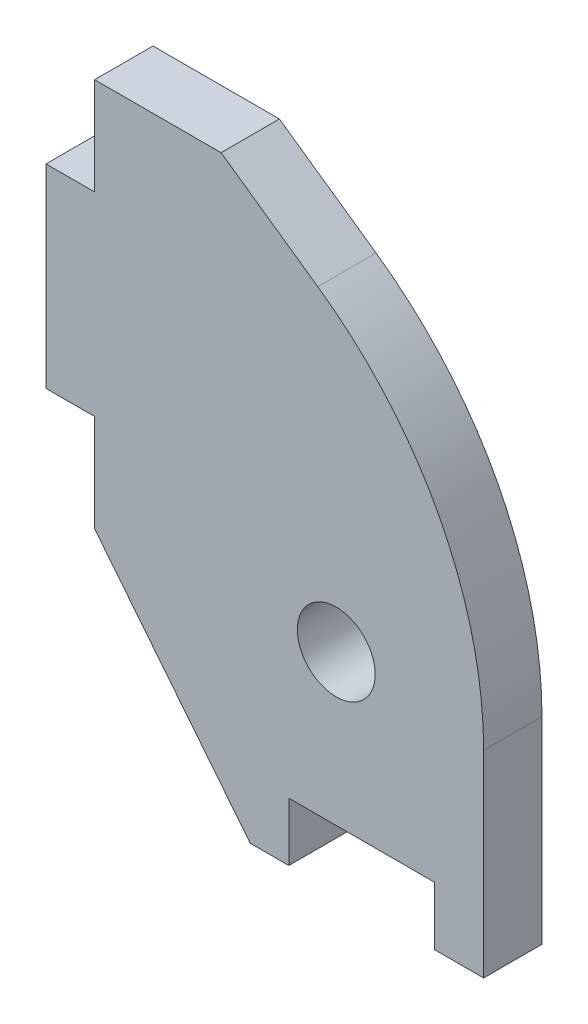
ISO-10303-21;
HEADER;
FILE_DESCRIPTION(('STEP AP214'),'2;1');
FILE_NAME('part.step','',(''),(''),'','','');
FILE_SCHEMA(('AUTOMOTIVE_DESIGN { 1 0 10303 214 1 1 1 1 }'));
ENDSEC;
DATA;
#1=APPLICATION_CONTEXT('core data for automotive mechanical design processes');
#2=APPLICATION_PROTOCOL_DEFINITION('international standard','automotive_design',2000,#1);
#3=PRODUCT_CONTEXT('',#1,'mechanical');
#4=PRODUCT('Part','Part','',(#3));
#5=PRODUCT_RELATED_PRODUCT_CATEGORY('part','',(#4));
#6=PRODUCT_DEFINITION_FORMATION('','',#4);
#7=PRODUCT_DEFINITION_CONTEXT('part definition',#1,'design');
#8=PRODUCT_DEFINITION('design','',#6,#7);
#9=PRODUCT_DEFINITION_SHAPE('','',#8);
#10=(LENGTH_UNIT() NAMED_UNIT(*) SI_UNIT(.MILLI.,.METRE.));
#11=(NAMED_UNIT(*) PLANE_ANGLE_UNIT() SI_UNIT($,.RADIAN.));
#12=(NAMED_UNIT(*) SI_UNIT($,.STERADIAN.) SOLID_ANGLE_UNIT());
#13=UNCERTAINTY_MEASURE_WITH_UNIT(LENGTH_MEASURE(1.E-05),#10,'distance_accuracy_value','');
#14=(GEOMETRIC_REPRESENTATION_CONTEXT(3) GLOBAL_UNCERTAINTY_ASSIGNED_CONTEXT((#13)) GLOBAL_UNIT_ASSIGNED_CONTEXT((#10,
#11,#12)) REPRESENTATION_CONTEXT('',''));
#15=CARTESIAN_POINT('',(0.,0.,0.));
#16=DIRECTION('',(0.,0.,1.));
#17=DIRECTION('',(1.,0.,0.));
#18=AXIS2_PLACEMENT_3D('',#15,#16,#17);
#19=CARTESIAN_POINT('',(0.,30.,3.));
#20=DIRECTION('',(1.,0.,0.));
#21=DIRECTION('',(0.,0.,-1.));
#22=AXIS2_PLACEMENT_3D('',#19,#20,#21);
#23=PLANE('',#22);
#24=DIRECTION('',(0.,0.,-1.));
#25=VECTOR('',#24,1.);
#26=CARTESIAN_POINT('',(0.,25.,0.));
#27=LINE('',#26,#25);
#28=CARTESIAN_POINT('',(0.,25.,3.));
#29=VERTEX_POINT('',#28);
#30=CARTESIAN_POINT('',(0.,25.,0.));
#31=VERTEX_POINT('',#30);
#32=EDGE_CURVE('E56',#29,#31,#27,.T.);
#33=ORIENTED_EDGE('',*,*,#32,.F.);
#34=DIRECTION('',(0.,-1.,0.));
#35=VECTOR('',#34,1.);
#36=CARTESIAN_POINT('',(0.,30.,3.));
#37=LINE('',#36,#35);
#38=CARTESIAN_POINT('',(0.,30.,3.));
#39=VERTEX_POINT('',#38);
#40=EDGE_CURVE('E782',#39,#29,#37,.T.);
#41=ORIENTED_EDGE('',*,*,#40,.F.);
#42=DIRECTION('',(0.,0.,-1.));
#43=VECTOR('',#42,1.);
#44=CARTESIAN_POINT('',(0.,30.,3.));
#45=LINE('',#44,#43);
#46=CARTESIAN_POINT('',(0.,30.,0.));
#47=VERTEX_POINT('',#46);
#48=EDGE_CURVE('E551',#39,#47,#45,.T.);
#49=ORIENTED_EDGE('',*,*,#48,.T.);
#50=DIRECTION('',(0.,-1.,0.));
#51=VECTOR('',#50,1.);
#52=CARTESIAN_POINT('',(0.,30.,0.));
#53=LINE('',#52,#51);
#54=EDGE_CURVE('E603',#47,#31,#53,.T.);
#55=ORIENTED_EDGE('',*,*,#54,.T.);
#56=EDGE_LOOP('',(#33,#41,#49,#55));
#57=FACE_BOUND('',#56,.T.);
#58=ADVANCED_FACE('F41',(#57),#23,.F.);
#59=DIRECTION('',(0.,0.,1.));
#60=VECTOR('',#59,1.);
#61=CARTESIAN_POINT('',(0.,15.,0.));
#62=LINE('',#61,#60);
#63=CARTESIAN_POINT('',(0.,15.,0.));
#64=VERTEX_POINT('',#63);
#65=CARTESIAN_POINT('',(0.,15.,3.));
#66=VERTEX_POINT('',#65);
#67=EDGE_CURVE('E64',#64,#66,#62,.T.);
#68=ORIENTED_EDGE('',*,*,#67,.F.);
#69=CARTESIAN_POINT('',(0.,10.,0.));
#70=VERTEX_POINT('',#69);
#71=EDGE_CURVE('E173',#64,#70,#53,.T.);
#72=ORIENTED_EDGE('',*,*,#71,.T.);
#73=DIRECTION('',(0.,0.,-1.));
#74=VECTOR('',#73,1.);
#75=CARTESIAN_POINT('',(0.,10.,3.));
#76=LINE('',#75,#74);
#77=CARTESIAN_POINT('',(0.,10.,3.));
#78=VERTEX_POINT('',#77);
#79=EDGE_CURVE('E12',#78,#70,#76,.T.);
#80=ORIENTED_EDGE('',*,*,#79,.F.);
#81=EDGE_CURVE('E785',#66,#78,#37,.T.);
#82=ORIENTED_EDGE('',*,*,#81,.F.);
#83=EDGE_LOOP('',(#68,#72,#80,#82));
#84=FACE_BOUND('',#83,.T.);
#85=ADVANCED_FACE('F1338',(#84),#23,.F.);
#86=CARTESIAN_POINT('',(8.,0.,3.));
#87=DIRECTION('',(0.,1.,0.));
#88=DIRECTION('',(0.,0.,1.));
#89=AXIS2_PLACEMENT_3D('',#86,#87,#88);
#90=PLANE('',#89);
#91=DIRECTION('',(1.,0.,0.));
#92=VECTOR('',#91,1.);
#93=CARTESIAN_POINT('',(8.,0.,0.));
#94=LINE('',#93,#92);
#95=CARTESIAN_POINT('',(8.,0.,0.));
#96=VERTEX_POINT('',#95);
#97=CARTESIAN_POINT('',(9.9819559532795,0.,0.));
#98=VERTEX_POINT('',#97);
#99=EDGE_CURVE('E949',#96,#98,#94,.T.);
#100=ORIENTED_EDGE('',*,*,#99,.T.);
#101=DIRECTION('',(0.,0.,1.));
#102=VECTOR('',#101,1.);
#103=CARTESIAN_POINT('',(9.9819559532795,0.,0.));
#104=LINE('',#103,#102);
#105=CARTESIAN_POINT('',(9.9819559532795,0.,3.));
#106=VERTEX_POINT('',#105);
#107=EDGE_CURVE('E1040',#98,#106,#104,.T.);
#108=ORIENTED_EDGE('',*,*,#107,.T.);
#109=DIRECTION('',(1.,0.,0.));
#110=VECTOR('',#109,1.);
#111=CARTESIAN_POINT('',(8.,0.,3.));
#112=LINE('',#111,#110);
#113=CARTESIAN_POINT('',(8.,0.,3.));
#114=VERTEX_POINT('',#113);
#115=EDGE_CURVE('E698',#114,#106,#112,.T.);
#116=ORIENTED_EDGE('',*,*,#115,.F.);
#117=DIRECTION('',(0.,0.,-1.));
#118=VECTOR('',#117,1.);
#119=CARTESIAN_POINT('',(8.,0.,3.));
#120=LINE('',#119,#118);
#121=EDGE_CURVE('E49',#114,#96,#120,.T.);
#122=ORIENTED_EDGE('',*,*,#121,.T.);
#123=EDGE_LOOP('',(#100,#108,#116,#122));
#124=FACE_BOUND('',#123,.T.);
#125=ADVANCED_FACE('F1323',(#124),#90,.F.);
#126=CARTESIAN_POINT('',(0.,10.,3.));
#127=DIRECTION('',(0.78086880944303,0.624695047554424,0.));
#128=DIRECTION('',(-0.624695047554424,0.78086880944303,0.));
#129=AXIS2_PLACEMENT_3D('',#126,#127,#128);
#130=PLANE('',#129);
#131=DIRECTION('',(0.624695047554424,-0.78086880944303,0.));
#132=VECTOR('',#131,1.);
#133=CARTESIAN_POINT('',(0.,10.,0.));
#134=LINE('',#133,#132);
#135=EDGE_CURVE('E953',#70,#96,#134,.T.);
#136=ORIENTED_EDGE('',*,*,#135,.T.);
#137=ORIENTED_EDGE('',*,*,#121,.F.);
#138=DIRECTION('',(0.624695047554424,-0.78086880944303,0.));
#139=VECTOR('',#138,1.);
#140=CARTESIAN_POINT('',(0.,10.,3.));
#141=LINE('',#140,#139);
#142=EDGE_CURVE('E703',#78,#114,#141,.T.);
#143=ORIENTED_EDGE('',*,*,#142,.F.);
#144=ORIENTED_EDGE('',*,*,#79,.T.);
#145=EDGE_LOOP('',(#136,#137,#143,#144));
#146=FACE_BOUND('',#145,.T.);
#147=ADVANCED_FACE('F1320',(#146),#130,.F.);
#148=CARTESIAN_POINT('',(17.4819559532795,0.,3.));
#149=VERTEX_POINT('',#148);
#150=CARTESIAN_POINT('',(20.,0.,3.));
#151=VERTEX_POINT('',#150);
#152=EDGE_CURVE('E702',#149,#151,#112,.T.);
#153=ORIENTED_EDGE('',*,*,#152,.F.);
#154=DIRECTION('',(0.,0.,1.));
#155=VECTOR('',#154,1.);
#156=CARTESIAN_POINT('',(17.4819559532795,0.,0.));
#157=LINE('',#156,#155);
#158=CARTESIAN_POINT('',(17.4819559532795,0.,0.));
#159=VERTEX_POINT('',#158);
#160=EDGE_CURVE('E1139',#159,#149,#157,.T.);
#161=ORIENTED_EDGE('',*,*,#160,.F.);
#162=CARTESIAN_POINT('',(20.,0.,0.));
#163=VERTEX_POINT('',#162);
#164=EDGE_CURVE('E952',#159,#163,#94,.T.);
#165=ORIENTED_EDGE('',*,*,#164,.T.);
#166=DIRECTION('',(0.,0.,-1.));
#167=VECTOR('',#166,1.);
#168=CARTESIAN_POINT('',(20.,0.,3.));
#169=LINE('',#168,#167);
#170=EDGE_CURVE('E440',#151,#163,#169,.T.);
#171=ORIENTED_EDGE('',*,*,#170,.F.);
#172=EDGE_LOOP('',(#153,#161,#165,#171));
#173=FACE_BOUND('',#172,.T.);
#174=ADVANCED_FACE('F1309',(#173),#90,.F.);
#175=CARTESIAN_POINT('',(20.,10.135857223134,3.));
#176=DIRECTION('',(-1.,0.,0.));
#177=DIRECTION('',(0.,0.,1.));
#178=AXIS2_PLACEMENT_3D('',#175,#176,#177);
#179=PLANE('',#178);
#180=DIRECTION('',(0.,1.,0.));
#181=VECTOR('',#180,1.);
#182=CARTESIAN_POINT('',(20.,10.135857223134,0.));
#183=LINE('',#182,#181);
#184=CARTESIAN_POINT('',(20.,10.135857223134,0.));
#185=VERTEX_POINT('',#184);
#186=EDGE_CURVE('E903',#163,#185,#183,.T.);
#187=ORIENTED_EDGE('',*,*,#186,.T.);
#188=DIRECTION('',(0.,0.,-1.));
#189=VECTOR('',#188,1.);
#190=CARTESIAN_POINT('',(20.,10.135857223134,3.));
#191=LINE('',#190,#189);
#192=CARTESIAN_POINT('',(20.,10.135857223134,3.));
#193=VERTEX_POINT('',#192);
#194=EDGE_CURVE('E501',#193,#185,#191,.T.);
#195=ORIENTED_EDGE('',*,*,#194,.F.);
#196=DIRECTION('',(0.,1.,0.));
#197=VECTOR('',#196,1.);
#198=CARTESIAN_POINT('',(20.,10.135857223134,3.));
#199=LINE('',#198,#197);
#200=EDGE_CURVE('E652',#151,#193,#199,.T.);
#201=ORIENTED_EDGE('',*,*,#200,.F.);
#202=ORIENTED_EDGE('',*,*,#170,.T.);
#203=EDGE_LOOP('',(#187,#195,#201,#202));
#204=FACE_BOUND('',#203,.T.);
#205=ADVANCED_FACE('F1351',(#204),#179,.F.);
#206=CARTESIAN_POINT('',(0.,10.135857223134,3.));
#207=DIRECTION('',(0.,0.,-1.));
#208=DIRECTION('',(-1.,0.,0.));
#209=AXIS2_PLACEMENT_3D('',#206,#207,#208);
#210=CYLINDRICAL_SURFACE('',#209,20.);
#211=CARTESIAN_POINT('',(0.,10.135857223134,0.));
#212=DIRECTION('',(0.,0.,1.));
#213=DIRECTION('',(-1.,0.,0.));
#214=AXIS2_PLACEMENT_3D('',#211,#212,#213);
#215=CIRCLE('',#214,20.);
#216=CARTESIAN_POINT('',(11.4715287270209,26.5188981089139,0.));
#217=VERTEX_POINT('',#216);
#218=EDGE_CURVE('E901',#185,#217,#215,.T.);
#219=ORIENTED_EDGE('',*,*,#218,.T.);
#220=DIRECTION('',(0.,0.,-1.));
#221=VECTOR('',#220,1.);
#222=CARTESIAN_POINT('',(11.4715287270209,26.5188981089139,3.));
#223=LINE('',#222,#221);
#224=CARTESIAN_POINT('',(11.4715287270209,26.5188981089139,3.));
#225=VERTEX_POINT('',#224);
#226=EDGE_CURVE('E504',#225,#217,#223,.T.);
#227=ORIENTED_EDGE('',*,*,#226,.F.);
#228=CARTESIAN_POINT('',(0.,10.135857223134,3.));
#229=DIRECTION('',(0.,0.,1.));
#230=DIRECTION('',(-1.,0.,0.));
#231=AXIS2_PLACEMENT_3D('',#228,#229,#230);
#232=CIRCLE('',#231,20.);
#233=EDGE_CURVE('E650',#193,#225,#232,.T.);
#234=ORIENTED_EDGE('',*,*,#233,.F.);
#235=ORIENTED_EDGE('',*,*,#194,.T.);
#236=EDGE_LOOP('',(#219,#227,#234,#235));
#237=FACE_BOUND('',#236,.T.);
#238=ADVANCED_FACE('F1355',(#237),#210,.T.);
#239=CARTESIAN_POINT('',(6.5,30.,3.));
#240=DIRECTION('',(-0.573576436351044,-0.819152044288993,0.));
#241=DIRECTION('',(0.819152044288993,-0.573576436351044,0.));
#242=AXIS2_PLACEMENT_3D('',#239,#240,#241);
#243=PLANE('',#242);
#244=DIRECTION('',(-0.819152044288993,0.573576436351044,0.));
#245=VECTOR('',#244,1.);
#246=CARTESIAN_POINT('',(6.5,30.,0.));
#247=LINE('',#246,#245);
#248=CARTESIAN_POINT('',(6.5,30.,0.));
#249=VERTEX_POINT('',#248);
#250=EDGE_CURVE('E865',#217,#249,#247,.T.);
#251=ORIENTED_EDGE('',*,*,#250,.T.);
#252=DIRECTION('',(0.,0.,-1.));
#253=VECTOR('',#252,1.);
#254=CARTESIAN_POINT('',(6.5,30.,3.));
#255=LINE('',#254,#253);
#256=CARTESIAN_POINT('',(6.5,30.,3.));
#257=VERTEX_POINT('',#256);
#258=EDGE_CURVE('E548',#257,#249,#255,.T.);
#259=ORIENTED_EDGE('',*,*,#258,.F.);
#260=DIRECTION('',(-0.819152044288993,0.573576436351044,0.));
#261=VECTOR('',#260,1.);
#262=CARTESIAN_POINT('',(6.5,30.,3.));
#263=LINE('',#262,#261);
#264=EDGE_CURVE('E600',#225,#257,#263,.T.);
#265=ORIENTED_EDGE('',*,*,#264,.F.);
#266=ORIENTED_EDGE('',*,*,#226,.T.);
#267=EDGE_LOOP('',(#251,#259,#265,#266));
#268=FACE_BOUND('',#267,.T.);
#269=ADVANCED_FACE('F1360',(#268),#243,.F.);
#270=CARTESIAN_POINT('',(0.,30.,3.));
#271=DIRECTION('',(0.,-1.,0.));
#272=DIRECTION('',(0.,0.,-1.));
#273=AXIS2_PLACEMENT_3D('',#270,#271,#272);
#274=PLANE('',#273);
#275=DIRECTION('',(-1.,0.,0.));
#276=VECTOR('',#275,1.);
#277=CARTESIAN_POINT('',(0.,30.,0.));
#278=LINE('',#277,#276);
#279=EDGE_CURVE('E863',#249,#47,#278,.T.);
#280=ORIENTED_EDGE('',*,*,#279,.T.);
#281=ORIENTED_EDGE('',*,*,#48,.F.);
#282=DIRECTION('',(-1.,0.,0.));
#283=VECTOR('',#282,1.);
#284=CARTESIAN_POINT('',(0.,30.,3.));
#285=LINE('',#284,#283);
#286=EDGE_CURVE('E597',#257,#39,#285,.T.);
#287=ORIENTED_EDGE('',*,*,#286,.F.);
#288=ORIENTED_EDGE('',*,*,#258,.T.);
#289=EDGE_LOOP('',(#280,#281,#287,#288));
#290=FACE_BOUND('',#289,.T.);
#291=ADVANCED_FACE('F1366',(#290),#274,.F.);
#292=CARTESIAN_POINT('',(0.,10.135857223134,3.));
#293=DIRECTION('',(0.,0.,-1.));
#294=DIRECTION('',(-1.,0.,0.));
#295=AXIS2_PLACEMENT_3D('',#292,#293,#294);
#296=PLANE('',#295);
#297=CARTESIAN_POINT('',(12.423290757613,10.7287967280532,3.));
#298=DIRECTION('',(0.,0.,1.));
#299=DIRECTION('',(1.,0.,0.));
#300=AXIS2_PLACEMENT_3D('',#297,#298,#299);
#301=CIRCLE('',#300,2.);
#302=CARTESIAN_POINT('',(14.423290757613,10.7287967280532,3.));
#303=VERTEX_POINT('',#302);
#304=EDGE_CURVE('E1035',#303,#303,#301,.T.);
#305=ORIENTED_EDGE('',*,*,#304,.F.);
#306=EDGE_LOOP('',(#305));
#307=FACE_BOUND('',#306,.T.);
#308=ORIENTED_EDGE('',*,*,#115,.T.);
#309=DIRECTION('',(0.,-1.,0.));
#310=VECTOR('',#309,1.);
#311=CARTESIAN_POINT('',(9.9819559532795,0.,3.));
#312=LINE('',#311,#310);
#313=CARTESIAN_POINT('',(9.9819559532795,3.,3.));
#314=VERTEX_POINT('',#313);
#315=EDGE_CURVE('E174',#314,#106,#312,.T.);
#316=ORIENTED_EDGE('',*,*,#315,.F.);
#317=DIRECTION('',(-1.,0.,0.));
#318=VECTOR('',#317,1.);
#319=CARTESIAN_POINT('',(9.9819559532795,3.,3.));
#320=LINE('',#319,#318);
#321=CARTESIAN_POINT('',(17.4819559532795,3.,3.));
#322=VERTEX_POINT('',#321);
#323=EDGE_CURVE('E1104',#322,#314,#320,.T.);
#324=ORIENTED_EDGE('',*,*,#323,.F.);
#325=DIRECTION('',(0.,1.,0.));
#326=VECTOR('',#325,1.);
#327=CARTESIAN_POINT('',(17.4819559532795,0.,3.));
#328=LINE('',#327,#326);
#329=EDGE_CURVE('E176',#149,#322,#328,.T.);
#330=ORIENTED_EDGE('',*,*,#329,.F.);
#331=ORIENTED_EDGE('',*,*,#152,.T.);
#332=ORIENTED_EDGE('',*,*,#200,.T.);
#333=ORIENTED_EDGE('',*,*,#233,.T.);
#334=ORIENTED_EDGE('',*,*,#264,.T.);
#335=ORIENTED_EDGE('',*,*,#286,.T.);
#336=ORIENTED_EDGE('',*,*,#40,.T.);
#337=DIRECTION('',(1.,0.,0.));
#338=VECTOR('',#337,1.);
#339=CARTESIAN_POINT('',(-2.5,25.,3.));
#340=LINE('',#339,#338);
#341=CARTESIAN_POINT('',(-2.5,25.,3.));
#342=VERTEX_POINT('',#341);
#343=EDGE_CURVE('E178',#342,#29,#340,.T.);
#344=ORIENTED_EDGE('',*,*,#343,.F.);
#345=DIRECTION('',(0.,1.,0.));
#346=VECTOR('',#345,1.);
#347=CARTESIAN_POINT('',(-2.5,15.,3.));
#348=LINE('',#347,#346);
#349=CARTESIAN_POINT('',(-2.5,15.,3.));
#350=VERTEX_POINT('',#349);
#351=EDGE_CURVE('E158',#350,#342,#348,.T.);
#352=ORIENTED_EDGE('',*,*,#351,.F.);
#353=DIRECTION('',(1.,0.,0.));
#354=VECTOR('',#353,1.);
#355=CARTESIAN_POINT('',(-2.5,15.,3.));
#356=LINE('',#355,#354);
#357=EDGE_CURVE('E155',#350,#66,#356,.T.);
#358=ORIENTED_EDGE('',*,*,#357,.T.);
#359=ORIENTED_EDGE('',*,*,#81,.T.);
#360=ORIENTED_EDGE('',*,*,#142,.T.);
#361=EDGE_LOOP('',(#308,#316,#324,#330,#331,#332,#333,#334,#335,#336,#344,#352,#358,#359,#360));
#362=FACE_BOUND('',#361,.T.);
#363=ADVANCED_FACE('F1316',(#307,#362),#296,.F.);
#364=CARTESIAN_POINT('',(0.,10.135857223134,0.));
#365=DIRECTION('',(0.,0.,-1.));
#366=DIRECTION('',(-1.,0.,0.));
#367=AXIS2_PLACEMENT_3D('',#364,#365,#366);
#368=PLANE('',#367);
#369=DIRECTION('',(0.,-1.,0.));
#370=VECTOR('',#369,1.);
#371=CARTESIAN_POINT('',(9.9819559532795,0.,0.));
#372=LINE('',#371,#370);
#373=CARTESIAN_POINT('',(9.9819559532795,3.,0.));
#374=VERTEX_POINT('',#373);
#375=EDGE_CURVE('E184',#374,#98,#372,.T.);
#376=ORIENTED_EDGE('',*,*,#375,.T.);
#377=ORIENTED_EDGE('',*,*,#99,.F.);
#378=ORIENTED_EDGE('',*,*,#135,.F.);
#379=ORIENTED_EDGE('',*,*,#71,.F.);
#380=DIRECTION('',(1.,0.,0.));
#381=VECTOR('',#380,1.);
#382=CARTESIAN_POINT('',(-2.5,15.,0.));
#383=LINE('',#382,#381);
#384=CARTESIAN_POINT('',(-2.5,15.,0.));
#385=VERTEX_POINT('',#384);
#386=EDGE_CURVE('E153',#385,#64,#383,.T.);
#387=ORIENTED_EDGE('',*,*,#386,.F.);
#388=DIRECTION('',(0.,-1.,0.));
#389=VECTOR('',#388,1.);
#390=CARTESIAN_POINT('',(-2.5,15.,0.));
#391=LINE('',#390,#389);
#392=CARTESIAN_POINT('',(-2.5,25.,0.));
#393=VERTEX_POINT('',#392);
#394=EDGE_CURVE('E159',#393,#385,#391,.T.);
#395=ORIENTED_EDGE('',*,*,#394,.F.);
#396=DIRECTION('',(1.,0.,0.));
#397=VECTOR('',#396,1.);
#398=CARTESIAN_POINT('',(-2.5,25.,0.));
#399=LINE('',#398,#397);
#400=EDGE_CURVE('E251',#393,#31,#399,.T.);
#401=ORIENTED_EDGE('',*,*,#400,.T.);
#402=ORIENTED_EDGE('',*,*,#54,.F.);
#403=ORIENTED_EDGE('',*,*,#279,.F.);
#404=ORIENTED_EDGE('',*,*,#250,.F.);
#405=ORIENTED_EDGE('',*,*,#218,.F.);
#406=ORIENTED_EDGE('',*,*,#186,.F.);
#407=ORIENTED_EDGE('',*,*,#164,.F.);
#408=DIRECTION('',(0.,1.,0.));
#409=VECTOR('',#408,1.);
#410=CARTESIAN_POINT('',(17.4819559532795,0.,0.));
#411=LINE('',#410,#409);
#412=CARTESIAN_POINT('',(17.4819559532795,3.,0.));
#413=VERTEX_POINT('',#412);
#414=EDGE_CURVE('E1187',#159,#413,#411,.T.);
#415=ORIENTED_EDGE('',*,*,#414,.T.);
#416=DIRECTION('',(-1.,0.,0.));
#417=VECTOR('',#416,1.);
#418=CARTESIAN_POINT('',(9.9819559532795,3.,0.));
#419=LINE('',#418,#417);
#420=EDGE_CURVE('E1184',#413,#374,#419,.T.);
#421=ORIENTED_EDGE('',*,*,#420,.T.);
#422=EDGE_LOOP('',(#376,#377,#378,#379,#387,#395,#401,#402,#403,#404,#405,#406,#407,#415,#421));
#423=FACE_BOUND('',#422,.T.);
#424=CARTESIAN_POINT('',(12.423290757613,10.7287967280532,0.));
#425=DIRECTION('',(0.,0.,1.));
#426=DIRECTION('',(1.,0.,0.));
#427=AXIS2_PLACEMENT_3D('',#424,#425,#426);
#428=CIRCLE('',#427,2.);
#429=CARTESIAN_POINT('',(14.423290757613,10.7287967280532,0.));
#430=VERTEX_POINT('',#429);
#431=EDGE_CURVE('E786',#430,#430,#428,.T.);
#432=ORIENTED_EDGE('',*,*,#431,.T.);
#433=EDGE_LOOP('',(#432));
#434=FACE_BOUND('',#433,.T.);
#435=ADVANCED_FACE('F170',(#423,#434),#368,.T.);
#436=CARTESIAN_POINT('',(12.423290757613,10.7287967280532,3.));
#437=DIRECTION('',(0.,0.,1.));
#438=DIRECTION('',(1.,0.,0.));
#439=AXIS2_PLACEMENT_3D('',#436,#437,#438);
#440=CYLINDRICAL_SURFACE('',#439,2.);
#441=ORIENTED_EDGE('',*,*,#431,.F.);
#442=EDGE_LOOP('',(#441));
#443=FACE_BOUND('',#442,.T.);
#444=ORIENTED_EDGE('',*,*,#304,.T.);
#445=EDGE_LOOP('',(#444));
#446=FACE_BOUND('',#445,.T.);
#447=ADVANCED_FACE('F1334',(#443,#446),#440,.F.);
#448=CARTESIAN_POINT('',(9.9819559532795,0.,0.));
#449=DIRECTION('',(-1.,0.,0.));
#450=DIRECTION('',(0.,0.,1.));
#451=AXIS2_PLACEMENT_3D('',#448,#449,#450);
#452=PLANE('',#451);
#453=ORIENTED_EDGE('',*,*,#315,.T.);
#454=ORIENTED_EDGE('',*,*,#107,.F.);
#455=ORIENTED_EDGE('',*,*,#375,.F.);
#456=DIRECTION('',(0.,0.,1.));
#457=VECTOR('',#456,1.);
#458=CARTESIAN_POINT('',(9.9819559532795,3.,0.));
#459=LINE('',#458,#457);
#460=EDGE_CURVE('E1039',#374,#314,#459,.T.);
#461=ORIENTED_EDGE('',*,*,#460,.T.);
#462=EDGE_LOOP('',(#453,#454,#455,#461));
#463=FACE_BOUND('',#462,.T.);
#464=ADVANCED_FACE('F1325',(#463),#452,.F.);
#465=CARTESIAN_POINT('',(9.9819559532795,3.,0.));
#466=DIRECTION('',(0.,1.,0.));
#467=DIRECTION('',(0.,0.,1.));
#468=AXIS2_PLACEMENT_3D('',#465,#466,#467);
#469=PLANE('',#468);
#470=ORIENTED_EDGE('',*,*,#323,.T.);
#471=ORIENTED_EDGE('',*,*,#460,.F.);
#472=ORIENTED_EDGE('',*,*,#420,.F.);
#473=DIRECTION('',(0.,0.,1.));
#474=VECTOR('',#473,1.);
#475=CARTESIAN_POINT('',(17.4819559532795,3.,0.));
#476=LINE('',#475,#474);
#477=EDGE_CURVE('E1103',#413,#322,#476,.T.);
#478=ORIENTED_EDGE('',*,*,#477,.T.);
#479=EDGE_LOOP('',(#470,#471,#472,#478));
#480=FACE_BOUND('',#479,.T.);
#481=ADVANCED_FACE('F1326',(#480),#469,.F.);
#482=CARTESIAN_POINT('',(17.4819559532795,0.,0.));
#483=DIRECTION('',(1.,0.,0.));
#484=DIRECTION('',(0.,0.,-1.));
#485=AXIS2_PLACEMENT_3D('',#482,#483,#484);
#486=PLANE('',#485);
#487=ORIENTED_EDGE('',*,*,#329,.T.);
#488=ORIENTED_EDGE('',*,*,#477,.F.);
#489=ORIENTED_EDGE('',*,*,#414,.F.);
#490=ORIENTED_EDGE('',*,*,#160,.T.);
#491=EDGE_LOOP('',(#487,#488,#489,#490));
#492=FACE_BOUND('',#491,.T.);
#493=ADVANCED_FACE('F1306',(#492),#486,.F.);
#494=CARTESIAN_POINT('',(-2.5,15.,0.));
#495=DIRECTION('',(0.,1.,0.));
#496=DIRECTION('',(0.,0.,1.));
#497=AXIS2_PLACEMENT_3D('',#494,#495,#496);
#498=PLANE('',#497);
#499=ORIENTED_EDGE('',*,*,#67,.T.);
#500=ORIENTED_EDGE('',*,*,#357,.F.);
#501=DIRECTION('',(0.,0.,1.));
#502=VECTOR('',#501,1.);
#503=CARTESIAN_POINT('',(-2.5,15.,0.));
#504=LINE('',#503,#502);
#505=EDGE_CURVE('E149',#385,#350,#504,.T.);
#506=ORIENTED_EDGE('',*,*,#505,.F.);
#507=ORIENTED_EDGE('',*,*,#386,.T.);
#508=EDGE_LOOP('',(#499,#500,#506,#507));
#509=FACE_BOUND('',#508,.T.);
#510=ADVANCED_FACE('F151',(#509),#498,.F.);
#511=CARTESIAN_POINT('',(-2.5,25.,0.));
#512=DIRECTION('',(0.,-1.,0.));
#513=DIRECTION('',(0.,0.,-1.));
#514=AXIS2_PLACEMENT_3D('',#511,#512,#513);
#515=PLANE('',#514);
#516=ORIENTED_EDGE('',*,*,#32,.T.);
#517=ORIENTED_EDGE('',*,*,#400,.F.);
#518=DIRECTION('',(0.,0.,-1.));
#519=VECTOR('',#518,1.);
#520=CARTESIAN_POINT('',(-2.5,25.,0.));
#521=LINE('',#520,#519);
#522=EDGE_CURVE('E164',#342,#393,#521,.T.);
#523=ORIENTED_EDGE('',*,*,#522,.F.);
#524=ORIENTED_EDGE('',*,*,#343,.T.);
#525=EDGE_LOOP('',(#516,#517,#523,#524));
#526=FACE_BOUND('',#525,.T.);
#527=ADVANCED_FACE('F1389',(#526),#515,.F.);
#528=CARTESIAN_POINT('',(-2.5,0.,0.));
#529=DIRECTION('',(1.,0.,0.));
#530=DIRECTION('',(0.,0.,-1.));
#531=AXIS2_PLACEMENT_3D('',#528,#529,#530);
#532=PLANE('',#531);
#533=ORIENTED_EDGE('',*,*,#394,.T.);
#534=ORIENTED_EDGE('',*,*,#505,.T.);
#535=ORIENTED_EDGE('',*,*,#351,.T.);
#536=ORIENTED_EDGE('',*,*,#522,.T.);
#537=EDGE_LOOP('',(#533,#534,#535,#536));
#538=FACE_BOUND('',#537,.T.);
#539=ADVANCED_FACE('F162',(#538),#532,.F.);
#540=CLOSED_SHELL('',(#58,#85,#125,#147,#174,#205,#238,#269,#291,#363,#435,#447,#464,#481,#493,
#510,#527,#539));
#541=MANIFOLD_SOLID_BREP('B2',#540);
#542=ADVANCED_BREP_SHAPE_REPRESENTATION('',(#18,#541),#14);
#543=SHAPE_DEFINITION_REPRESENTATION(#9,#542);
ENDSEC;
END-ISO-10303-21;
